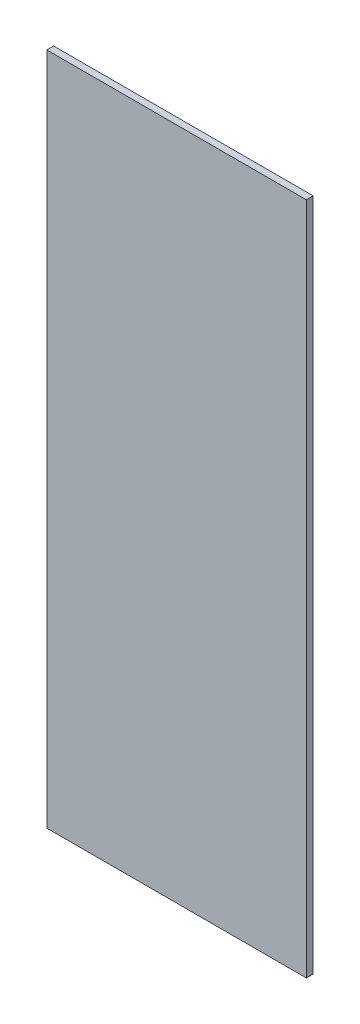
ISO-10303-21;
HEADER;
FILE_DESCRIPTION(('STEP AP214'),'2;1');
FILE_NAME('part.step','',(''),(''),'','','');
FILE_SCHEMA(('AUTOMOTIVE_DESIGN { 1 0 10303 214 1 1 1 1 }'));
ENDSEC;
DATA;
#1=APPLICATION_CONTEXT('core data for automotive mechanical design processes');
#2=APPLICATION_PROTOCOL_DEFINITION('international standard','automotive_design',2000,#1);
#3=PRODUCT_CONTEXT('',#1,'mechanical');
#4=PRODUCT('Part','Part','',(#3));
#5=PRODUCT_RELATED_PRODUCT_CATEGORY('part','',(#4));
#6=PRODUCT_DEFINITION_FORMATION('','',#4);
#7=PRODUCT_DEFINITION_CONTEXT('part definition',#1,'design');
#8=PRODUCT_DEFINITION('design','',#6,#7);
#9=PRODUCT_DEFINITION_SHAPE('','',#8);
#10=(LENGTH_UNIT() NAMED_UNIT(*) SI_UNIT(.MILLI.,.METRE.));
#11=(NAMED_UNIT(*) PLANE_ANGLE_UNIT() SI_UNIT($,.RADIAN.));
#12=(NAMED_UNIT(*) SI_UNIT($,.STERADIAN.) SOLID_ANGLE_UNIT());
#13=UNCERTAINTY_MEASURE_WITH_UNIT(LENGTH_MEASURE(1.E-05),#10,'distance_accuracy_value','');
#14=(GEOMETRIC_REPRESENTATION_CONTEXT(3) GLOBAL_UNCERTAINTY_ASSIGNED_CONTEXT((#13)) GLOBAL_UNIT_ASSIGNED_CONTEXT((#10,
#11,#12)) REPRESENTATION_CONTEXT('',''));
#15=CARTESIAN_POINT('',(0.,0.,0.));
#16=DIRECTION('',(0.,0.,1.));
#17=DIRECTION('',(1.,0.,0.));
#18=AXIS2_PLACEMENT_3D('',#15,#16,#17);
#19=CARTESIAN_POINT('',(-285.,-740.,15.));
#20=DIRECTION('',(1.,0.,0.));
#21=DIRECTION('',(0.,0.,-1.));
#22=AXIS2_PLACEMENT_3D('',#19,#20,#21);
#23=PLANE('',#22);
#24=DIRECTION('',(0.,-1.,0.));
#25=VECTOR('',#24,1.);
#26=CARTESIAN_POINT('',(-285.,-740.,0.));
#27=LINE('',#26,#25);
#28=CARTESIAN_POINT('',(-285.,740.,0.));
#29=VERTEX_POINT('',#28);
#30=CARTESIAN_POINT('',(-285.,-740.,0.));
#31=VERTEX_POINT('',#30);
#32=EDGE_CURVE('E113',#29,#31,#27,.T.);
#33=ORIENTED_EDGE('',*,*,#32,.T.);
#34=DIRECTION('',(0.,0.,-1.));
#35=VECTOR('',#34,1.);
#36=CARTESIAN_POINT('',(-285.,-740.,15.));
#37=LINE('',#36,#35);
#38=CARTESIAN_POINT('',(-285.,-740.,15.));
#39=VERTEX_POINT('',#38);
#40=EDGE_CURVE('E11',#39,#31,#37,.T.);
#41=ORIENTED_EDGE('',*,*,#40,.F.);
#42=DIRECTION('',(0.,-1.,0.));
#43=VECTOR('',#42,1.);
#44=CARTESIAN_POINT('',(-285.,-740.,15.));
#45=LINE('',#44,#43);
#46=CARTESIAN_POINT('',(-285.,740.,15.));
#47=VERTEX_POINT('',#46);
#48=EDGE_CURVE('E97',#47,#39,#45,.T.);
#49=ORIENTED_EDGE('',*,*,#48,.F.);
#50=DIRECTION('',(0.,0.,-1.));
#51=VECTOR('',#50,1.);
#52=CARTESIAN_POINT('',(-285.,740.,15.));
#53=LINE('',#52,#51);
#54=EDGE_CURVE('E109',#47,#29,#53,.T.);
#55=ORIENTED_EDGE('',*,*,#54,.T.);
#56=EDGE_LOOP('',(#33,#41,#49,#55));
#57=FACE_BOUND('',#56,.T.);
#58=ADVANCED_FACE('F45',(#57),#23,.F.);
#59=CARTESIAN_POINT('',(285.,-740.,15.));
#60=DIRECTION('',(0.,1.,0.));
#61=DIRECTION('',(-1.,0.,0.));
#62=AXIS2_PLACEMENT_3D('',#59,#60,#61);
#63=PLANE('',#62);
#64=DIRECTION('',(1.,0.,0.));
#65=VECTOR('',#64,1.);
#66=CARTESIAN_POINT('',(285.,-740.,0.));
#67=LINE('',#66,#65);
#68=CARTESIAN_POINT('',(285.,-740.,0.));
#69=VERTEX_POINT('',#68);
#70=EDGE_CURVE('E102',#31,#69,#67,.T.);
#71=ORIENTED_EDGE('',*,*,#70,.T.);
#72=DIRECTION('',(0.,0.,-1.));
#73=VECTOR('',#72,1.);
#74=CARTESIAN_POINT('',(285.,-740.,15.));
#75=LINE('',#74,#73);
#76=CARTESIAN_POINT('',(285.,-740.,15.));
#77=VERTEX_POINT('',#76);
#78=EDGE_CURVE('E54',#77,#69,#75,.T.);
#79=ORIENTED_EDGE('',*,*,#78,.F.);
#80=DIRECTION('',(1.,0.,0.));
#81=VECTOR('',#80,1.);
#82=CARTESIAN_POINT('',(285.,-740.,15.));
#83=LINE('',#82,#81);
#84=EDGE_CURVE('E92',#39,#77,#83,.T.);
#85=ORIENTED_EDGE('',*,*,#84,.F.);
#86=ORIENTED_EDGE('',*,*,#40,.T.);
#87=EDGE_LOOP('',(#71,#79,#85,#86));
#88=FACE_BOUND('',#87,.T.);
#89=ADVANCED_FACE('F101',(#88),#63,.F.);
#90=CARTESIAN_POINT('',(285.,-740.,15.));
#91=DIRECTION('',(-1.,0.,0.));
#92=DIRECTION('',(0.,0.,1.));
#93=AXIS2_PLACEMENT_3D('',#90,#91,#92);
#94=PLANE('',#93);
#95=DIRECTION('',(0.,1.,0.));
#96=VECTOR('',#95,1.);
#97=CARTESIAN_POINT('',(285.,-740.,0.));
#98=LINE('',#97,#96);
#99=CARTESIAN_POINT('',(285.,740.,0.));
#100=VERTEX_POINT('',#99);
#101=EDGE_CURVE('E79',#69,#100,#98,.T.);
#102=ORIENTED_EDGE('',*,*,#101,.T.);
#103=DIRECTION('',(0.,0.,-1.));
#104=VECTOR('',#103,1.);
#105=CARTESIAN_POINT('',(285.,740.,15.));
#106=LINE('',#105,#104);
#107=CARTESIAN_POINT('',(285.,740.,15.));
#108=VERTEX_POINT('',#107);
#109=EDGE_CURVE('E104',#108,#100,#106,.T.);
#110=ORIENTED_EDGE('',*,*,#109,.F.);
#111=DIRECTION('',(0.,1.,0.));
#112=VECTOR('',#111,1.);
#113=CARTESIAN_POINT('',(285.,-740.,15.));
#114=LINE('',#113,#112);
#115=EDGE_CURVE('E95',#77,#108,#114,.T.);
#116=ORIENTED_EDGE('',*,*,#115,.F.);
#117=ORIENTED_EDGE('',*,*,#78,.T.);
#118=EDGE_LOOP('',(#102,#110,#116,#117));
#119=FACE_BOUND('',#118,.T.);
#120=ADVANCED_FACE('F105',(#119),#94,.F.);
#121=CARTESIAN_POINT('',(285.,740.,15.));
#122=DIRECTION('',(0.,-1.,0.));
#123=DIRECTION('',(1.,0.,0.));
#124=AXIS2_PLACEMENT_3D('',#121,#122,#123);
#125=PLANE('',#124);
#126=DIRECTION('',(-1.,0.,0.));
#127=VECTOR('',#126,1.);
#128=CARTESIAN_POINT('',(285.,740.,0.));
#129=LINE('',#128,#127);
#130=EDGE_CURVE('E85',#100,#29,#129,.T.);
#131=ORIENTED_EDGE('',*,*,#130,.T.);
#132=ORIENTED_EDGE('',*,*,#54,.F.);
#133=DIRECTION('',(-1.,0.,0.));
#134=VECTOR('',#133,1.);
#135=CARTESIAN_POINT('',(285.,740.,15.));
#136=LINE('',#135,#134);
#137=EDGE_CURVE('E62',#108,#47,#136,.T.);
#138=ORIENTED_EDGE('',*,*,#137,.F.);
#139=ORIENTED_EDGE('',*,*,#109,.T.);
#140=EDGE_LOOP('',(#131,#132,#138,#139));
#141=FACE_BOUND('',#140,.T.);
#142=ADVANCED_FACE('F126',(#141),#125,.F.);
#143=CARTESIAN_POINT('',(0.,0.,15.));
#144=DIRECTION('',(0.,0.,1.));
#145=DIRECTION('',(1.,0.,0.));
#146=AXIS2_PLACEMENT_3D('',#143,#144,#145);
#147=PLANE('',#146);
#148=ORIENTED_EDGE('',*,*,#48,.T.);
#149=ORIENTED_EDGE('',*,*,#84,.T.);
#150=ORIENTED_EDGE('',*,*,#115,.T.);
#151=ORIENTED_EDGE('',*,*,#137,.T.);
#152=EDGE_LOOP('',(#148,#149,#150,#151));
#153=FACE_BOUND('',#152,.T.);
#154=ADVANCED_FACE('F93',(#153),#147,.T.);
#155=CARTESIAN_POINT('',(0.,0.,0.));
#156=DIRECTION('',(0.,0.,1.));
#157=DIRECTION('',(1.,0.,0.));
#158=AXIS2_PLACEMENT_3D('',#155,#156,#157);
#159=PLANE('',#158);
#160=ORIENTED_EDGE('',*,*,#32,.F.);
#161=ORIENTED_EDGE('',*,*,#130,.F.);
#162=ORIENTED_EDGE('',*,*,#101,.F.);
#163=ORIENTED_EDGE('',*,*,#70,.F.);
#164=EDGE_LOOP('',(#160,#161,#162,#163));
#165=FACE_BOUND('',#164,.T.);
#166=ADVANCED_FACE('F129',(#165),#159,.F.);
#167=CLOSED_SHELL('',(#58,#89,#120,#142,#154,#166));
#168=MANIFOLD_SOLID_BREP('B2',#167);
#169=ADVANCED_BREP_SHAPE_REPRESENTATION('',(#18,#168),#14);
#170=SHAPE_DEFINITION_REPRESENTATION(#9,#169);
ENDSEC;
END-ISO-10303-21;
